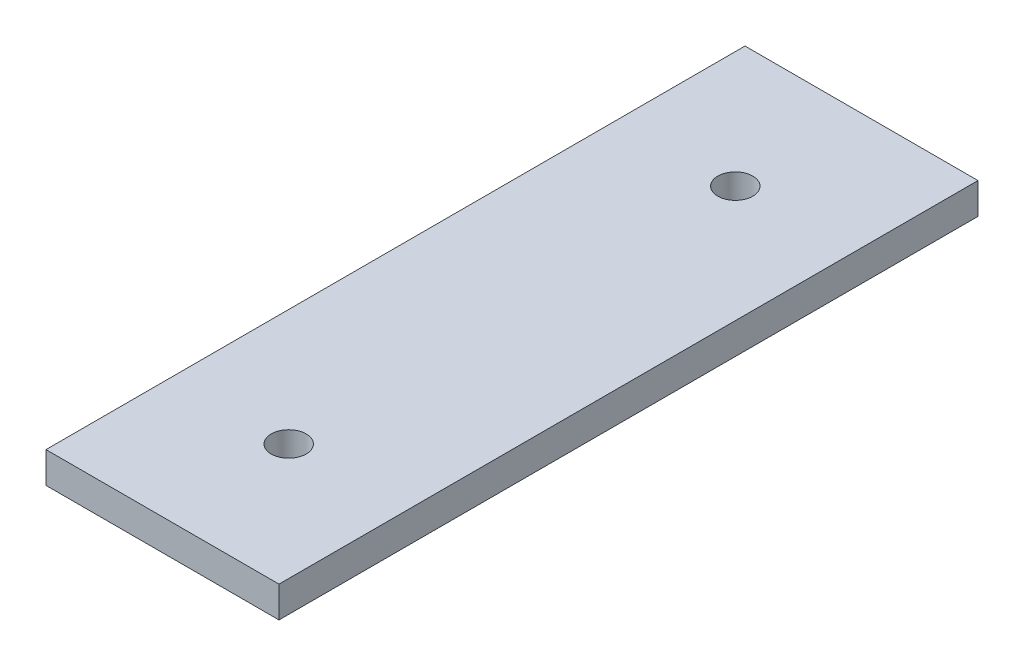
ISO-10303-21;
HEADER;
FILE_DESCRIPTION(('STEP AP214'),'2;1');
FILE_NAME('part.step','',(''),(''),'','','');
FILE_SCHEMA(('AUTOMOTIVE_DESIGN { 1 0 10303 214 1 1 1 1 }'));
ENDSEC;
DATA;
#1=APPLICATION_CONTEXT('core data for automotive mechanical design processes');
#2=APPLICATION_PROTOCOL_DEFINITION('international standard','automotive_design',2000,#1);
#3=PRODUCT_CONTEXT('',#1,'mechanical');
#4=PRODUCT('Part','Part','',(#3));
#5=PRODUCT_RELATED_PRODUCT_CATEGORY('part','',(#4));
#6=PRODUCT_DEFINITION_FORMATION('','',#4);
#7=PRODUCT_DEFINITION_CONTEXT('part definition',#1,'design');
#8=PRODUCT_DEFINITION('design','',#6,#7);
#9=PRODUCT_DEFINITION_SHAPE('','',#8);
#10=(LENGTH_UNIT() NAMED_UNIT(*) SI_UNIT(.MILLI.,.METRE.));
#11=(NAMED_UNIT(*) PLANE_ANGLE_UNIT() SI_UNIT($,.RADIAN.));
#12=(NAMED_UNIT(*) SI_UNIT($,.STERADIAN.) SOLID_ANGLE_UNIT());
#13=UNCERTAINTY_MEASURE_WITH_UNIT(LENGTH_MEASURE(1.E-05),#10,'distance_accuracy_value','');
#14=(GEOMETRIC_REPRESENTATION_CONTEXT(3) GLOBAL_UNCERTAINTY_ASSIGNED_CONTEXT((#13)) GLOBAL_UNIT_ASSIGNED_CONTEXT((#10,
#11,#12)) REPRESENTATION_CONTEXT('',''));
#15=CARTESIAN_POINT('',(0.,0.,0.));
#16=DIRECTION('',(0.,0.,1.));
#17=DIRECTION('',(1.,0.,0.));
#18=AXIS2_PLACEMENT_3D('',#15,#16,#17);
#19=CARTESIAN_POINT('',(0.,0.,180.));
#20=DIRECTION('',(1.,0.,0.));
#21=DIRECTION('',(0.,1.,0.));
#22=AXIS2_PLACEMENT_3D('',#19,#20,#21);
#23=PLANE('',#22);
#24=DIRECTION('',(0.,-1.,0.));
#25=VECTOR('',#24,1.);
#26=CARTESIAN_POINT('',(0.,0.,0.));
#27=LINE('',#26,#25);
#28=CARTESIAN_POINT('',(0.,0.,0.));
#29=VERTEX_POINT('',#28);
#30=CARTESIAN_POINT('',(0.,-8.00000000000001,0.));
#31=VERTEX_POINT('',#30);
#32=EDGE_CURVE('E73',#29,#31,#27,.T.);
#33=ORIENTED_EDGE('',*,*,#32,.T.);
#34=DIRECTION('',(0.,0.,-1.));
#35=VECTOR('',#34,1.);
#36=CARTESIAN_POINT('',(0.,-8.00000000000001,180.));
#37=LINE('',#36,#35);
#38=CARTESIAN_POINT('',(0.,-8.00000000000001,180.));
#39=VERTEX_POINT('',#38);
#40=EDGE_CURVE('E11',#39,#31,#37,.T.);
#41=ORIENTED_EDGE('',*,*,#40,.F.);
#42=DIRECTION('',(0.,-1.,0.));
#43=VECTOR('',#42,1.);
#44=CARTESIAN_POINT('',(0.,0.,180.));
#45=LINE('',#44,#43);
#46=CARTESIAN_POINT('',(0.,0.,180.));
#47=VERTEX_POINT('',#46);
#48=EDGE_CURVE('E96',#47,#39,#45,.T.);
#49=ORIENTED_EDGE('',*,*,#48,.F.);
#50=DIRECTION('',(0.,0.,-1.));
#51=VECTOR('',#50,1.);
#52=CARTESIAN_POINT('',(0.,0.,180.));
#53=LINE('',#52,#51);
#54=EDGE_CURVE('E85',#47,#29,#53,.T.);
#55=ORIENTED_EDGE('',*,*,#54,.T.);
#56=EDGE_LOOP('',(#33,#41,#49,#55));
#57=FACE_BOUND('',#56,.T.);
#58=ADVANCED_FACE('F29',(#57),#23,.F.);
#59=CARTESIAN_POINT('',(0.,-8.00000000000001,180.));
#60=DIRECTION('',(0.,1.,0.));
#61=DIRECTION('',(0.,0.,1.));
#62=AXIS2_PLACEMENT_3D('',#59,#60,#61);
#63=PLANE('',#62);
#64=CARTESIAN_POINT('',(30.,-8.00000000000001,32.5));
#65=DIRECTION('',(0.,1.,0.));
#66=DIRECTION('',(0.,0.,1.));
#67=AXIS2_PLACEMENT_3D('',#64,#65,#66);
#68=CIRCLE('',#67,4.5);
#69=CARTESIAN_POINT('',(30.,-8.00000000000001,37.));
#70=VERTEX_POINT('',#69);
#71=EDGE_CURVE('E131',#70,#70,#68,.T.);
#72=ORIENTED_EDGE('',*,*,#71,.T.);
#73=EDGE_LOOP('',(#72));
#74=FACE_BOUND('',#73,.T.);
#75=CARTESIAN_POINT('',(30.,-8.00000000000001,147.5));
#76=DIRECTION('',(0.,1.,0.));
#77=DIRECTION('',(0.,0.,1.));
#78=AXIS2_PLACEMENT_3D('',#75,#76,#77);
#79=CIRCLE('',#78,4.50000000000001);
#80=CARTESIAN_POINT('',(30.,-8.00000000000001,152.));
#81=VERTEX_POINT('',#80);
#82=EDGE_CURVE('E86',#81,#81,#79,.T.);
#83=ORIENTED_EDGE('',*,*,#82,.T.);
#84=EDGE_LOOP('',(#83));
#85=FACE_BOUND('',#84,.T.);
#86=DIRECTION('',(1.,0.,0.));
#87=VECTOR('',#86,1.);
#88=CARTESIAN_POINT('',(0.,-8.00000000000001,0.));
#89=LINE('',#88,#87);
#90=CARTESIAN_POINT('',(60.,-8.00000000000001,0.));
#91=VERTEX_POINT('',#90);
#92=EDGE_CURVE('E69',#31,#91,#89,.T.);
#93=ORIENTED_EDGE('',*,*,#92,.T.);
#94=DIRECTION('',(0.,0.,-1.));
#95=VECTOR('',#94,1.);
#96=CARTESIAN_POINT('',(60.,-8.00000000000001,180.));
#97=LINE('',#96,#95);
#98=CARTESIAN_POINT('',(60.,-8.00000000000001,180.));
#99=VERTEX_POINT('',#98);
#100=EDGE_CURVE('E36',#99,#91,#97,.T.);
#101=ORIENTED_EDGE('',*,*,#100,.F.);
#102=DIRECTION('',(1.,0.,0.));
#103=VECTOR('',#102,1.);
#104=CARTESIAN_POINT('',(0.,-8.00000000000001,180.));
#105=LINE('',#104,#103);
#106=EDGE_CURVE('E81',#39,#99,#105,.T.);
#107=ORIENTED_EDGE('',*,*,#106,.F.);
#108=ORIENTED_EDGE('',*,*,#40,.T.);
#109=EDGE_LOOP('',(#93,#101,#107,#108));
#110=FACE_BOUND('',#109,.T.);
#111=ADVANCED_FACE('F80',(#74,#85,#110),#63,.F.);
#112=CARTESIAN_POINT('',(60.,0.,180.));
#113=DIRECTION('',(-1.,0.,0.));
#114=DIRECTION('',(0.,0.,1.));
#115=AXIS2_PLACEMENT_3D('',#112,#113,#114);
#116=PLANE('',#115);
#117=DIRECTION('',(0.,1.,0.));
#118=VECTOR('',#117,1.);
#119=CARTESIAN_POINT('',(60.,0.,0.));
#120=LINE('',#119,#118);
#121=CARTESIAN_POINT('',(60.,0.,0.));
#122=VERTEX_POINT('',#121);
#123=EDGE_CURVE('E74',#91,#122,#120,.T.);
#124=ORIENTED_EDGE('',*,*,#123,.T.);
#125=DIRECTION('',(0.,0.,-1.));
#126=VECTOR('',#125,1.);
#127=CARTESIAN_POINT('',(60.,0.,180.));
#128=LINE('',#127,#126);
#129=CARTESIAN_POINT('',(60.,0.,180.));
#130=VERTEX_POINT('',#129);
#131=EDGE_CURVE('E102',#130,#122,#128,.T.);
#132=ORIENTED_EDGE('',*,*,#131,.F.);
#133=DIRECTION('',(0.,1.,0.));
#134=VECTOR('',#133,1.);
#135=CARTESIAN_POINT('',(60.,0.,180.));
#136=LINE('',#135,#134);
#137=EDGE_CURVE('E48',#99,#130,#136,.T.);
#138=ORIENTED_EDGE('',*,*,#137,.F.);
#139=ORIENTED_EDGE('',*,*,#100,.T.);
#140=EDGE_LOOP('',(#124,#132,#138,#139));
#141=FACE_BOUND('',#140,.T.);
#142=ADVANCED_FACE('F105',(#141),#116,.F.);
#143=CARTESIAN_POINT('',(0.,0.,180.));
#144=DIRECTION('',(0.,-1.,0.));
#145=DIRECTION('',(0.,0.,-1.));
#146=AXIS2_PLACEMENT_3D('',#143,#144,#145);
#147=PLANE('',#146);
#148=CARTESIAN_POINT('',(30.,0.,32.5));
#149=DIRECTION('',(0.,1.,0.));
#150=DIRECTION('',(0.,0.,1.));
#151=AXIS2_PLACEMENT_3D('',#148,#149,#150);
#152=CIRCLE('',#151,4.5);
#153=CARTESIAN_POINT('',(30.,0.,37.));
#154=VERTEX_POINT('',#153);
#155=EDGE_CURVE('E146',#154,#154,#152,.T.);
#156=ORIENTED_EDGE('',*,*,#155,.F.);
#157=EDGE_LOOP('',(#156));
#158=FACE_BOUND('',#157,.T.);
#159=CARTESIAN_POINT('',(30.,0.,147.5));
#160=DIRECTION('',(0.,1.,0.));
#161=DIRECTION('',(0.,0.,1.));
#162=AXIS2_PLACEMENT_3D('',#159,#160,#161);
#163=CIRCLE('',#162,4.50000000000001);
#164=CARTESIAN_POINT('',(30.,0.,152.));
#165=VERTEX_POINT('',#164);
#166=EDGE_CURVE('E89',#165,#165,#163,.T.);
#167=ORIENTED_EDGE('',*,*,#166,.F.);
#168=EDGE_LOOP('',(#167));
#169=FACE_BOUND('',#168,.T.);
#170=DIRECTION('',(-1.,0.,0.));
#171=VECTOR('',#170,1.);
#172=CARTESIAN_POINT('',(0.,0.,0.));
#173=LINE('',#172,#171);
#174=EDGE_CURVE('E94',#122,#29,#173,.T.);
#175=ORIENTED_EDGE('',*,*,#174,.T.);
#176=ORIENTED_EDGE('',*,*,#54,.F.);
#177=DIRECTION('',(-1.,0.,0.));
#178=VECTOR('',#177,1.);
#179=CARTESIAN_POINT('',(0.,0.,180.));
#180=LINE('',#179,#178);
#181=EDGE_CURVE('E43',#130,#47,#180,.T.);
#182=ORIENTED_EDGE('',*,*,#181,.F.);
#183=ORIENTED_EDGE('',*,*,#131,.T.);
#184=EDGE_LOOP('',(#175,#176,#182,#183));
#185=FACE_BOUND('',#184,.T.);
#186=ADVANCED_FACE('F107',(#158,#169,#185),#147,.F.);
#187=CARTESIAN_POINT('',(0.,-8.00000000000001,180.));
#188=DIRECTION('',(0.,0.,1.));
#189=DIRECTION('',(1.,0.,0.));
#190=AXIS2_PLACEMENT_3D('',#187,#188,#189);
#191=PLANE('',#190);
#192=ORIENTED_EDGE('',*,*,#48,.T.);
#193=ORIENTED_EDGE('',*,*,#106,.T.);
#194=ORIENTED_EDGE('',*,*,#137,.T.);
#195=ORIENTED_EDGE('',*,*,#181,.T.);
#196=EDGE_LOOP('',(#192,#193,#194,#195));
#197=FACE_BOUND('',#196,.T.);
#198=ADVANCED_FACE('F108',(#197),#191,.T.);
#199=CARTESIAN_POINT('',(0.,-8.00000000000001,0.));
#200=DIRECTION('',(0.,0.,1.));
#201=DIRECTION('',(1.,0.,0.));
#202=AXIS2_PLACEMENT_3D('',#199,#200,#201);
#203=PLANE('',#202);
#204=ORIENTED_EDGE('',*,*,#32,.F.);
#205=ORIENTED_EDGE('',*,*,#174,.F.);
#206=ORIENTED_EDGE('',*,*,#123,.F.);
#207=ORIENTED_EDGE('',*,*,#92,.F.);
#208=EDGE_LOOP('',(#204,#205,#206,#207));
#209=FACE_BOUND('',#208,.T.);
#210=ADVANCED_FACE('F70',(#209),#203,.F.);
#211=CARTESIAN_POINT('',(30.,-9.99999999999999,147.5));
#212=DIRECTION('',(0.,1.,0.));
#213=DIRECTION('',(0.,0.,1.));
#214=AXIS2_PLACEMENT_3D('',#211,#212,#213);
#215=CYLINDRICAL_SURFACE('',#214,4.50000000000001);
#216=ORIENTED_EDGE('',*,*,#166,.T.);
#217=EDGE_LOOP('',(#216));
#218=FACE_BOUND('',#217,.T.);
#219=ORIENTED_EDGE('',*,*,#82,.F.);
#220=EDGE_LOOP('',(#219));
#221=FACE_BOUND('',#220,.T.);
#222=ADVANCED_FACE('F115',(#218,#221),#215,.F.);
#223=CARTESIAN_POINT('',(30.,-9.99999999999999,32.5));
#224=DIRECTION('',(0.,1.,0.));
#225=DIRECTION('',(0.,0.,1.));
#226=AXIS2_PLACEMENT_3D('',#223,#224,#225);
#227=CYLINDRICAL_SURFACE('',#226,4.5);
#228=ORIENTED_EDGE('',*,*,#155,.T.);
#229=EDGE_LOOP('',(#228));
#230=FACE_BOUND('',#229,.T.);
#231=ORIENTED_EDGE('',*,*,#71,.F.);
#232=EDGE_LOOP('',(#231));
#233=FACE_BOUND('',#232,.T.);
#234=ADVANCED_FACE('F135',(#230,#233),#227,.F.);
#235=CLOSED_SHELL('',(#58,#111,#142,#186,#198,#210,#222,#234));
#236=MANIFOLD_SOLID_BREP('B2',#235);
#237=ADVANCED_BREP_SHAPE_REPRESENTATION('',(#18,#236),#14);
#238=SHAPE_DEFINITION_REPRESENTATION(#9,#237);
ENDSEC;
END-ISO-10303-21;
